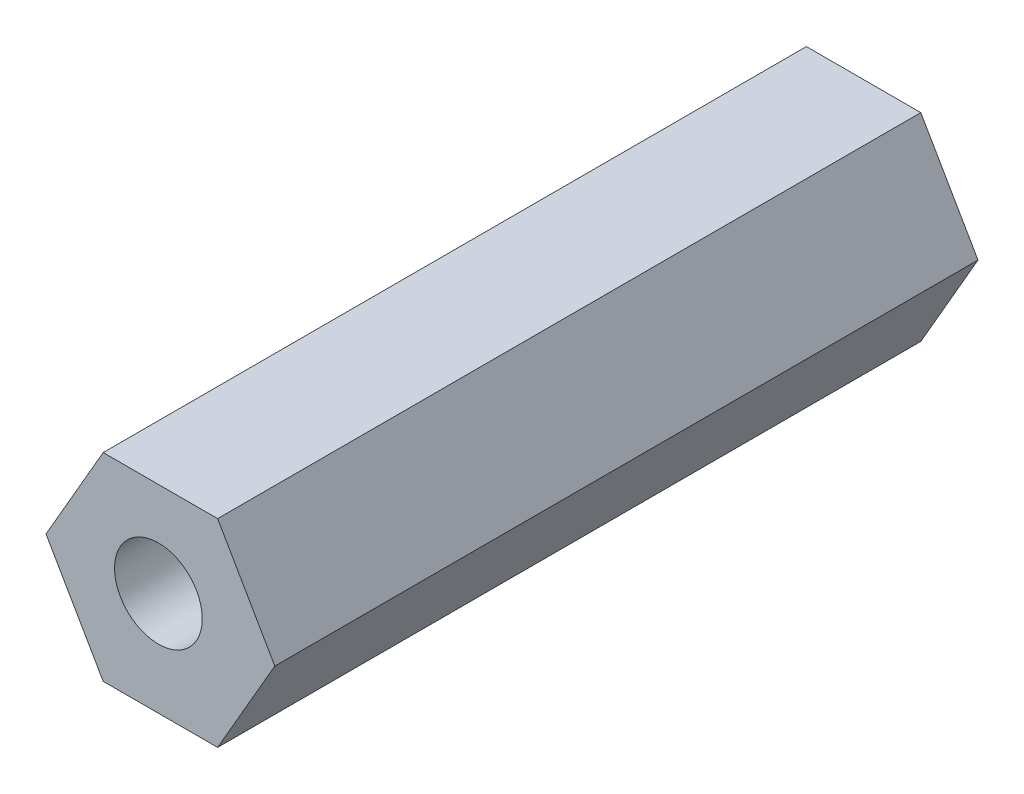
ISO-10303-21;
HEADER;
FILE_DESCRIPTION(('STEP AP214'),'2;1');
FILE_NAME('part.step','',(''),(''),'','','');
FILE_SCHEMA(('AUTOMOTIVE_DESIGN { 1 0 10303 214 1 1 1 1 }'));
ENDSEC;
DATA;
#1=APPLICATION_CONTEXT('core data for automotive mechanical design processes');
#2=APPLICATION_PROTOCOL_DEFINITION('international standard','automotive_design',2000,#1);
#3=PRODUCT_CONTEXT('',#1,'mechanical');
#4=PRODUCT('Part','Part','',(#3));
#5=PRODUCT_RELATED_PRODUCT_CATEGORY('part','',(#4));
#6=PRODUCT_DEFINITION_FORMATION('','',#4);
#7=PRODUCT_DEFINITION_CONTEXT('part definition',#1,'design');
#8=PRODUCT_DEFINITION('design','',#6,#7);
#9=PRODUCT_DEFINITION_SHAPE('','',#8);
#10=(LENGTH_UNIT() NAMED_UNIT(*) SI_UNIT(.MILLI.,.METRE.));
#11=(NAMED_UNIT(*) PLANE_ANGLE_UNIT() SI_UNIT($,.RADIAN.));
#12=(NAMED_UNIT(*) SI_UNIT($,.STERADIAN.) SOLID_ANGLE_UNIT());
#13=UNCERTAINTY_MEASURE_WITH_UNIT(LENGTH_MEASURE(1.E-05),#10,'distance_accuracy_value','');
#14=(GEOMETRIC_REPRESENTATION_CONTEXT(3) GLOBAL_UNCERTAINTY_ASSIGNED_CONTEXT((#13)) GLOBAL_UNIT_ASSIGNED_CONTEXT((#10,
#11,#12)) REPRESENTATION_CONTEXT('',''));
#15=CARTESIAN_POINT('',(0.,0.,0.));
#16=DIRECTION('',(0.,0.,1.));
#17=DIRECTION('',(1.,0.,0.));
#18=AXIS2_PLACEMENT_3D('',#15,#16,#17);
#19=CARTESIAN_POINT('',(10.9985226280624,0.,67.6));
#20=DIRECTION('',(-0.866025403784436,-0.500000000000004,0.));
#21=DIRECTION('',(0.500000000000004,-0.866025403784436,0.));
#22=AXIS2_PLACEMENT_3D('',#19,#20,#21);
#23=PLANE('',#22);
#24=DIRECTION('',(-0.500000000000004,0.866025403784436,0.));
#25=VECTOR('',#24,1.);
#26=CARTESIAN_POINT('',(10.9985226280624,0.,0.));
#27=LINE('',#26,#25);
#28=CARTESIAN_POINT('',(10.9985226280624,0.,0.));
#29=VERTEX_POINT('',#28);
#30=CARTESIAN_POINT('',(5.49926131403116,9.52500000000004,0.));
#31=VERTEX_POINT('',#30);
#32=EDGE_CURVE('E125',#29,#31,#27,.T.);
#33=ORIENTED_EDGE('',*,*,#32,.T.);
#34=DIRECTION('',(0.,0.,-1.));
#35=VECTOR('',#34,1.);
#36=CARTESIAN_POINT('',(5.49926131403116,9.52500000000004,67.6));
#37=LINE('',#36,#35);
#38=CARTESIAN_POINT('',(5.49926131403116,9.52500000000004,67.6));
#39=VERTEX_POINT('',#38);
#40=EDGE_CURVE('E11',#39,#31,#37,.T.);
#41=ORIENTED_EDGE('',*,*,#40,.F.);
#42=DIRECTION('',(-0.500000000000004,0.866025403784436,0.));
#43=VECTOR('',#42,1.);
#44=CARTESIAN_POINT('',(10.9985226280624,0.,67.6));
#45=LINE('',#44,#43);
#46=CARTESIAN_POINT('',(10.9985226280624,0.,67.6));
#47=VERTEX_POINT('',#46);
#48=EDGE_CURVE('E137',#47,#39,#45,.T.);
#49=ORIENTED_EDGE('',*,*,#48,.F.);
#50=DIRECTION('',(0.,0.,-1.));
#51=VECTOR('',#50,1.);
#52=CARTESIAN_POINT('',(10.9985226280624,0.,67.6));
#53=LINE('',#52,#51);
#54=EDGE_CURVE('E121',#47,#29,#53,.T.);
#55=ORIENTED_EDGE('',*,*,#54,.T.);
#56=EDGE_LOOP('',(#33,#41,#49,#55));
#57=FACE_BOUND('',#56,.T.);
#58=ADVANCED_FACE('F41',(#57),#23,.F.);
#59=CARTESIAN_POINT('',(5.49926131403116,9.52500000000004,67.6));
#60=DIRECTION('',(0.,-1.,0.));
#61=DIRECTION('',(1.,0.,0.));
#62=AXIS2_PLACEMENT_3D('',#59,#60,#61);
#63=PLANE('',#62);
#64=DIRECTION('',(-1.,0.,0.));
#65=VECTOR('',#64,1.);
#66=CARTESIAN_POINT('',(5.49926131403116,9.52500000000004,0.));
#67=LINE('',#66,#65);
#68=CARTESIAN_POINT('',(-5.49926131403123,9.52499999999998,0.));
#69=VERTEX_POINT('',#68);
#70=EDGE_CURVE('E128',#31,#69,#67,.T.);
#71=ORIENTED_EDGE('',*,*,#70,.T.);
#72=DIRECTION('',(0.,0.,-1.));
#73=VECTOR('',#72,1.);
#74=CARTESIAN_POINT('',(-5.49926131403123,9.52499999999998,67.6));
#75=LINE('',#74,#73);
#76=CARTESIAN_POINT('',(-5.49926131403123,9.52499999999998,67.6));
#77=VERTEX_POINT('',#76);
#78=EDGE_CURVE('E49',#77,#69,#75,.T.);
#79=ORIENTED_EDGE('',*,*,#78,.F.);
#80=DIRECTION('',(-1.,0.,0.));
#81=VECTOR('',#80,1.);
#82=CARTESIAN_POINT('',(5.49926131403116,9.52500000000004,67.6));
#83=LINE('',#82,#81);
#84=EDGE_CURVE('E94',#39,#77,#83,.T.);
#85=ORIENTED_EDGE('',*,*,#84,.F.);
#86=ORIENTED_EDGE('',*,*,#40,.T.);
#87=EDGE_LOOP('',(#71,#79,#85,#86));
#88=FACE_BOUND('',#87,.T.);
#89=ADVANCED_FACE('F163',(#88),#63,.F.);
#90=CARTESIAN_POINT('',(-5.49926131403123,9.52499999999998,67.6));
#91=DIRECTION('',(0.866025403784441,-0.499999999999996,0.));
#92=DIRECTION('',(0.499999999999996,0.866025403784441,0.));
#93=AXIS2_PLACEMENT_3D('',#90,#91,#92);
#94=PLANE('',#93);
#95=DIRECTION('',(-0.499999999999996,-0.866025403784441,0.));
#96=VECTOR('',#95,1.);
#97=CARTESIAN_POINT('',(-5.49926131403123,9.52499999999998,0.));
#98=LINE('',#97,#96);
#99=CARTESIAN_POINT('',(-10.9985226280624,0.,0.));
#100=VERTEX_POINT('',#99);
#101=EDGE_CURVE('E131',#69,#100,#98,.T.);
#102=ORIENTED_EDGE('',*,*,#101,.T.);
#103=DIRECTION('',(0.,0.,-1.));
#104=VECTOR('',#103,1.);
#105=CARTESIAN_POINT('',(-10.9985226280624,0.,67.6));
#106=LINE('',#105,#104);
#107=CARTESIAN_POINT('',(-10.9985226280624,0.,67.6));
#108=VERTEX_POINT('',#107);
#109=EDGE_CURVE('E116',#108,#100,#106,.T.);
#110=ORIENTED_EDGE('',*,*,#109,.F.);
#111=DIRECTION('',(-0.499999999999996,-0.866025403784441,0.));
#112=VECTOR('',#111,1.);
#113=CARTESIAN_POINT('',(-5.49926131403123,9.52499999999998,67.6));
#114=LINE('',#113,#112);
#115=EDGE_CURVE('E107',#77,#108,#114,.T.);
#116=ORIENTED_EDGE('',*,*,#115,.F.);
#117=ORIENTED_EDGE('',*,*,#78,.T.);
#118=EDGE_LOOP('',(#102,#110,#116,#117));
#119=FACE_BOUND('',#118,.T.);
#120=ADVANCED_FACE('F144',(#119),#94,.F.);
#121=CARTESIAN_POINT('',(-10.9985226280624,0.,67.6));
#122=DIRECTION('',(0.866025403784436,0.500000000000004,0.));
#123=DIRECTION('',(-0.500000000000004,0.866025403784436,0.));
#124=AXIS2_PLACEMENT_3D('',#121,#122,#123);
#125=PLANE('',#124);
#126=DIRECTION('',(0.500000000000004,-0.866025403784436,0.));
#127=VECTOR('',#126,1.);
#128=CARTESIAN_POINT('',(-10.9985226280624,0.,0.));
#129=LINE('',#128,#127);
#130=CARTESIAN_POINT('',(-5.49926131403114,-9.52500000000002,0.));
#131=VERTEX_POINT('',#130);
#132=EDGE_CURVE('E115',#100,#131,#129,.T.);
#133=ORIENTED_EDGE('',*,*,#132,.T.);
#134=DIRECTION('',(0.,0.,-1.));
#135=VECTOR('',#134,1.);
#136=CARTESIAN_POINT('',(-5.49926131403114,-9.52500000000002,67.6));
#137=LINE('',#136,#135);
#138=CARTESIAN_POINT('',(-5.49926131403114,-9.52500000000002,67.6));
#139=VERTEX_POINT('',#138);
#140=EDGE_CURVE('E112',#139,#131,#137,.T.);
#141=ORIENTED_EDGE('',*,*,#140,.F.);
#142=DIRECTION('',(0.500000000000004,-0.866025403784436,0.));
#143=VECTOR('',#142,1.);
#144=CARTESIAN_POINT('',(-10.9985226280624,0.,67.6));
#145=LINE('',#144,#143);
#146=EDGE_CURVE('E101',#108,#139,#145,.T.);
#147=ORIENTED_EDGE('',*,*,#146,.F.);
#148=ORIENTED_EDGE('',*,*,#109,.T.);
#149=EDGE_LOOP('',(#133,#141,#147,#148));
#150=FACE_BOUND('',#149,.T.);
#151=ADVANCED_FACE('F113',(#150),#125,.F.);
#152=CARTESIAN_POINT('',(-5.49926131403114,-9.52500000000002,67.6));
#153=DIRECTION('',(0.,1.,0.));
#154=DIRECTION('',(-1.,0.,0.));
#155=AXIS2_PLACEMENT_3D('',#152,#153,#154);
#156=PLANE('',#155);
#157=DIRECTION('',(1.,0.,0.));
#158=VECTOR('',#157,1.);
#159=CARTESIAN_POINT('',(-5.49926131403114,-9.52500000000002,0.));
#160=LINE('',#159,#158);
#161=CARTESIAN_POINT('',(5.49926131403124,-9.525,0.));
#162=VERTEX_POINT('',#161);
#163=EDGE_CURVE('E80',#131,#162,#160,.T.);
#164=ORIENTED_EDGE('',*,*,#163,.T.);
#165=DIRECTION('',(0.,0.,-1.));
#166=VECTOR('',#165,1.);
#167=CARTESIAN_POINT('',(5.49926131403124,-9.525,67.6));
#168=LINE('',#167,#166);
#169=CARTESIAN_POINT('',(5.49926131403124,-9.525,67.6));
#170=VERTEX_POINT('',#169);
#171=EDGE_CURVE('E117',#170,#162,#168,.T.);
#172=ORIENTED_EDGE('',*,*,#171,.F.);
#173=DIRECTION('',(1.,0.,0.));
#174=VECTOR('',#173,1.);
#175=CARTESIAN_POINT('',(-5.49926131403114,-9.52500000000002,67.6));
#176=LINE('',#175,#174);
#177=EDGE_CURVE('E105',#139,#170,#176,.T.);
#178=ORIENTED_EDGE('',*,*,#177,.F.);
#179=ORIENTED_EDGE('',*,*,#140,.T.);
#180=EDGE_LOOP('',(#164,#172,#178,#179));
#181=FACE_BOUND('',#180,.T.);
#182=ADVANCED_FACE('F119',(#181),#156,.F.);
#183=CARTESIAN_POINT('',(5.49926131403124,-9.525,67.6));
#184=DIRECTION('',(-0.866025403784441,0.499999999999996,0.));
#185=DIRECTION('',(-0.499999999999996,-0.866025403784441,0.));
#186=AXIS2_PLACEMENT_3D('',#183,#184,#185);
#187=PLANE('',#186);
#188=DIRECTION('',(0.499999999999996,0.866025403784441,0.));
#189=VECTOR('',#188,1.);
#190=CARTESIAN_POINT('',(5.49926131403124,-9.525,0.));
#191=LINE('',#190,#189);
#192=EDGE_CURVE('E86',#162,#29,#191,.T.);
#193=ORIENTED_EDGE('',*,*,#192,.T.);
#194=ORIENTED_EDGE('',*,*,#54,.F.);
#195=DIRECTION('',(0.499999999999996,0.866025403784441,0.));
#196=VECTOR('',#195,1.);
#197=CARTESIAN_POINT('',(5.49926131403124,-9.525,67.6));
#198=LINE('',#197,#196);
#199=EDGE_CURVE('E57',#170,#47,#198,.T.);
#200=ORIENTED_EDGE('',*,*,#199,.F.);
#201=ORIENTED_EDGE('',*,*,#171,.T.);
#202=EDGE_LOOP('',(#193,#194,#200,#201));
#203=FACE_BOUND('',#202,.T.);
#204=ADVANCED_FACE('F151',(#203),#187,.F.);
#205=CARTESIAN_POINT('',(5.49926131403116,9.52500000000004,67.6));
#206=DIRECTION('',(0.,0.,1.));
#207=DIRECTION('',(1.,0.,0.));
#208=AXIS2_PLACEMENT_3D('',#205,#206,#207);
#209=PLANE('',#208);
#210=CARTESIAN_POINT('',(-0.194451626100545,0.443320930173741,67.6));
#211=DIRECTION('',(0.,0.,1.));
#212=DIRECTION('',(1.,0.,0.));
#213=AXIS2_PLACEMENT_3D('',#210,#211,#212);
#214=CIRCLE('',#213,4.21639999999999);
#215=CARTESIAN_POINT('',(4.02194837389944,0.443320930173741,67.6));
#216=VERTEX_POINT('',#215);
#217=EDGE_CURVE('E247',#216,#216,#214,.T.);
#218=ORIENTED_EDGE('',*,*,#217,.F.);
#219=EDGE_LOOP('',(#218));
#220=FACE_BOUND('',#219,.T.);
#221=ORIENTED_EDGE('',*,*,#48,.T.);
#222=ORIENTED_EDGE('',*,*,#84,.T.);
#223=ORIENTED_EDGE('',*,*,#115,.T.);
#224=ORIENTED_EDGE('',*,*,#146,.T.);
#225=ORIENTED_EDGE('',*,*,#177,.T.);
#226=ORIENTED_EDGE('',*,*,#199,.T.);
#227=EDGE_LOOP('',(#221,#222,#223,#224,#225,#226));
#228=FACE_BOUND('',#227,.T.);
#229=ADVANCED_FACE('F103',(#220,#228),#209,.T.);
#230=CARTESIAN_POINT('',(5.49926131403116,9.52500000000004,0.));
#231=DIRECTION('',(0.,0.,1.));
#232=DIRECTION('',(1.,0.,0.));
#233=AXIS2_PLACEMENT_3D('',#230,#231,#232);
#234=PLANE('',#233);
#235=CARTESIAN_POINT('',(-0.194451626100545,0.443320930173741,0.));
#236=DIRECTION('',(0.,0.,1.));
#237=DIRECTION('',(1.,0.,0.));
#238=AXIS2_PLACEMENT_3D('',#235,#236,#237);
#239=CIRCLE('',#238,4.85139999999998);
#240=CARTESIAN_POINT('',(4.65694837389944,0.443320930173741,0.));
#241=VERTEX_POINT('',#240);
#242=EDGE_CURVE('E248',#241,#241,#239,.T.);
#243=ORIENTED_EDGE('',*,*,#242,.T.);
#244=EDGE_LOOP('',(#243));
#245=FACE_BOUND('',#244,.T.);
#246=ORIENTED_EDGE('',*,*,#32,.F.);
#247=ORIENTED_EDGE('',*,*,#192,.F.);
#248=ORIENTED_EDGE('',*,*,#163,.F.);
#249=ORIENTED_EDGE('',*,*,#132,.F.);
#250=ORIENTED_EDGE('',*,*,#101,.F.);
#251=ORIENTED_EDGE('',*,*,#70,.F.);
#252=EDGE_LOOP('',(#246,#247,#248,#249,#250,#251));
#253=FACE_BOUND('',#252,.T.);
#254=ADVANCED_FACE('F147',(#245,#253),#234,.F.);
#255=CARTESIAN_POINT('',(-0.194451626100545,0.443320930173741,0.635000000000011));
#256=DIRECTION('',(0.,0.,-1.));
#257=DIRECTION('',(-1.,0.,0.));
#258=AXIS2_PLACEMENT_3D('',#255,#256,#257);
#259=CONICAL_SURFACE('',#258,4.21639999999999,0.785398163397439);
#260=ORIENTED_EDGE('',*,*,#242,.F.);
#261=EDGE_LOOP('',(#260));
#262=FACE_BOUND('',#261,.T.);
#263=CARTESIAN_POINT('',(-0.194451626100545,0.443320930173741,0.635000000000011));
#264=DIRECTION('',(0.,0.,1.));
#265=DIRECTION('',(1.,0.,0.));
#266=AXIS2_PLACEMENT_3D('',#263,#264,#265);
#267=CIRCLE('',#266,4.21639999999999);
#268=CARTESIAN_POINT('',(4.02194837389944,0.443320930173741,0.635000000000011));
#269=VERTEX_POINT('',#268);
#270=EDGE_CURVE('E129',#269,#269,#267,.T.);
#271=ORIENTED_EDGE('',*,*,#270,.T.);
#272=EDGE_LOOP('',(#271));
#273=FACE_BOUND('',#272,.T.);
#274=ADVANCED_FACE('F202',(#262,#273),#259,.F.);
#275=CARTESIAN_POINT('',(-0.194451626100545,0.443320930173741,67.6));
#276=DIRECTION('',(0.,0.,1.));
#277=DIRECTION('',(1.,0.,0.));
#278=AXIS2_PLACEMENT_3D('',#275,#276,#277);
#279=CYLINDRICAL_SURFACE('',#278,4.21639999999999);
#280=ORIENTED_EDGE('',*,*,#270,.F.);
#281=EDGE_LOOP('',(#280));
#282=FACE_BOUND('',#281,.T.);
#283=ORIENTED_EDGE('',*,*,#217,.T.);
#284=EDGE_LOOP('',(#283));
#285=FACE_BOUND('',#284,.T.);
#286=ADVANCED_FACE('F211',(#282,#285),#279,.F.);
#287=CLOSED_SHELL('',(#58,#89,#120,#151,#182,#204,#229,#254,#274,#286));
#288=MANIFOLD_SOLID_BREP('B2',#287);
#289=ADVANCED_BREP_SHAPE_REPRESENTATION('',(#18,#288),#14);
#290=SHAPE_DEFINITION_REPRESENTATION(#9,#289);
ENDSEC;
END-ISO-10303-21;
